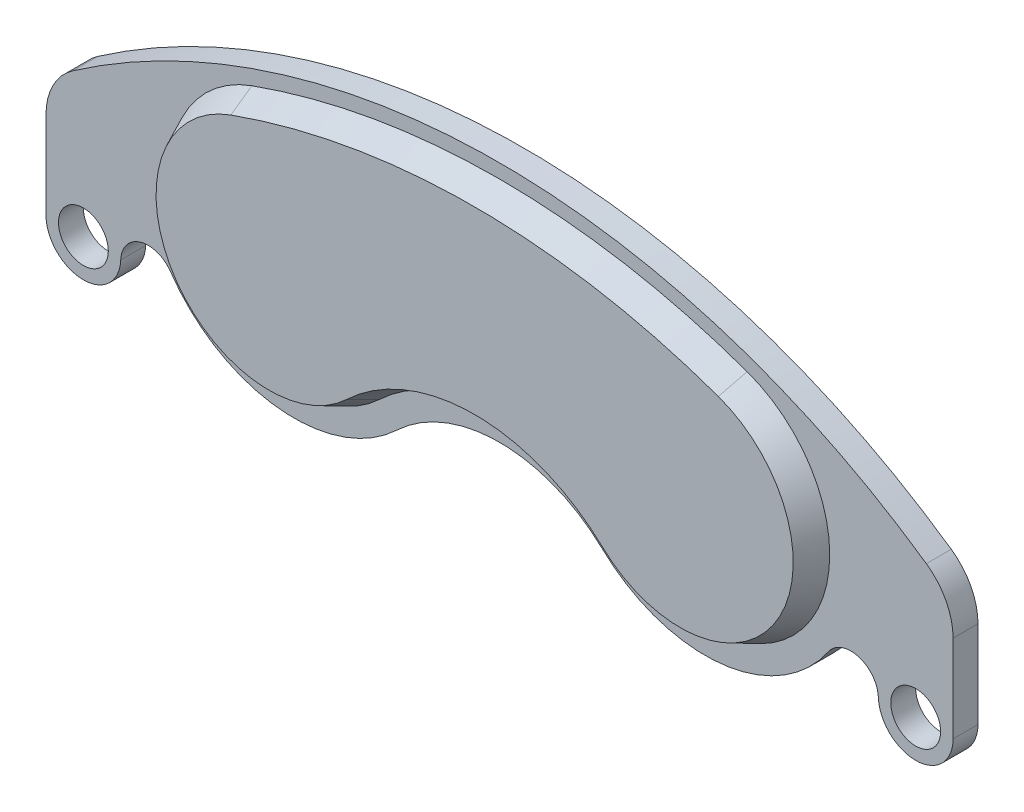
from build123d import *

# Parameters (mm, degrees)
BOSS_EXTRUDE1_DEPTH = 1.27
BOSS_EXTRUDE2_DEPTH = 2.54
BOSS_EXTRUDE2_TAPER = 25
CUT_EXTRUDE1_REACH  = 91.162
SKETCH3_R           = 2.54


with BuildPart() as part:
    # Sketch1 → Boss-Extrude1 (new, symmetric)
    with BuildSketch(Plane.XY):
        with BuildLine():
            Line((-46.228, 57.347777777), (-46.228, 48.457777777))
            ThreePointArc((-46.228, 48.457777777), (-42.490196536, 44.648461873), (-38.610736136, 48.313410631))
            ThreePointArc((-38.610736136, 48.313410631), (-36.596377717, 50.891143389), (-33.51590927, 49.789753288))
            ThreePointArc((-33.51590927, 49.789753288), (-22.558013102, 43.264540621), (-10.4775, 47.352950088))
            ThreePointArc((-10.4775, 47.352950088), (0, 51.525900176), (10.4775, 47.352950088))
            ThreePointArc((10.4775, 47.352950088), (22.558013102, 43.264540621), (33.51590927, 49.789753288))
            ThreePointArc((33.51590927, 49.789753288), (36.596377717, 50.891143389), (38.610736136, 48.313410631))
            ThreePointArc((38.610736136, 48.313410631), (42.490196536, 44.648461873), (46.228, 48.457777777))
            Line((46.228, 48.457777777), (46.228, 57.347777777))
            ThreePointArc((46.228, 57.347777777), (45.505742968, 60.289037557), (43.503272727, 62.561212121))
            ThreePointArc((43.503272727, 62.561212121), (0, 76.2), (-43.503272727, 62.561212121))
            ThreePointArc((-43.503272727, 62.561212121), (-45.505742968, 60.289037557), (-46.228, 57.347777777))
        make_face()
    extrude(amount=BOSS_EXTRUDE1_DEPTH, both=True)

    # Sketch2 → Boss-Extrude2 (add)
    with BuildSketch(Plane.XY.offset(1.27)):
        with BuildLine():
            ThreePointArc((-25.24293084, 70.374231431), (-31.773950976, 51.768661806), (-12.22375, 49.197458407))
            ThreePointArc((-12.22375, 49.197458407), (0, 54.065900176), (12.22375, 49.197458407))
            ThreePointArc((12.22375, 49.197458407), (31.773950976, 51.768661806), (25.24293084, 70.374231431))
            ThreePointArc((25.24293084, 70.374231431), (0, 74.76455047), (-25.24293084, 70.374231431))
        make_face()
    extrude(amount=BOSS_EXTRUDE2_DEPTH, taper=BOSS_EXTRUDE2_TAPER)

    # Sketch3 → Cut-Extrude1 (cut, up to next)
    with BuildSketch(Plane.XY.offset(1.27), mode=Mode.PRIVATE) as cut_extrude1_sk1:
        with Locations((-42.418, 48.457777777)):
            Circle(SKETCH3_R)
    cut_extrude1_tool1 = extrude(cut_extrude1_sk1.sketch, amount=-CUT_EXTRUDE1_REACH, mode=Mode.PRIVATE) & part.part
    # Sketch3 → Cut-Extrude1 (cut, up to next)
    with BuildSketch(Plane.XY.offset(1.27), mode=Mode.PRIVATE) as cut_extrude1_sk2:
        with Locations((42.418, 48.457777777)):
            Circle(SKETCH3_R)
    cut_extrude1_tool2 = extrude(cut_extrude1_sk2.sketch, amount=-CUT_EXTRUDE1_REACH, mode=Mode.PRIVATE) & part.part
    add(cut_extrude1_tool1.solids().sort_by_distance((-42.418, 48.457778, 1.27))[0], mode=Mode.SUBTRACT)
    add(cut_extrude1_tool2.solids().sort_by_distance((42.418, 48.457778, 1.27))[0], mode=Mode.SUBTRACT)


solid = part.part
